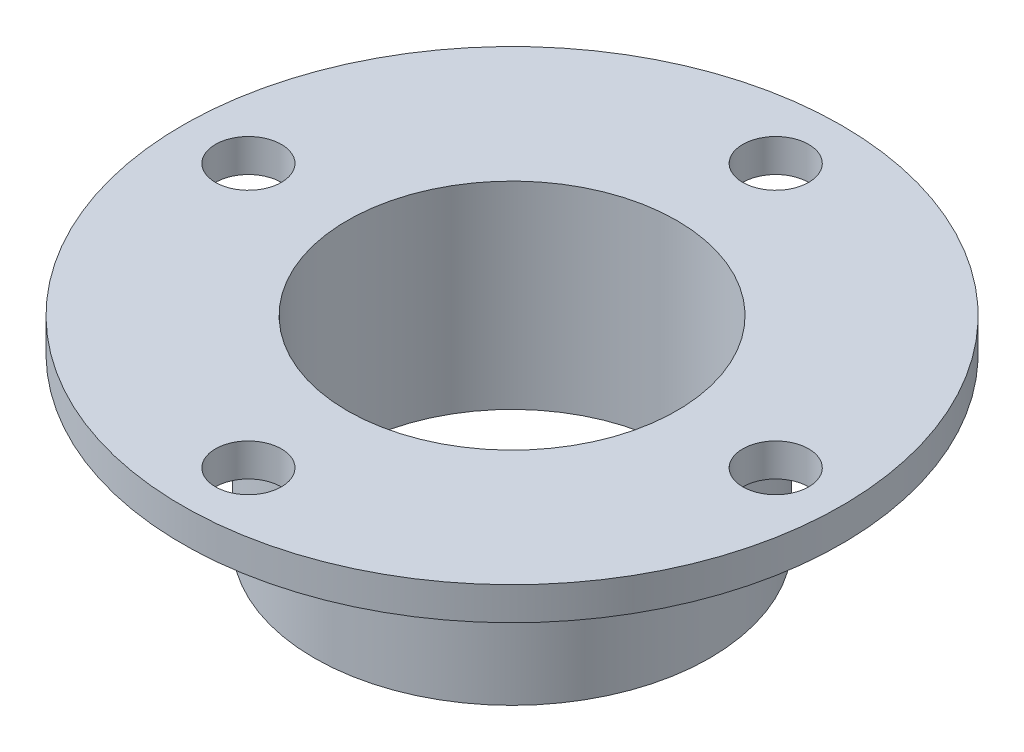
from build123d import *

# Parameters (mm, degrees)
SKETCH2_R          = 31.75
CUT_EXTRUDE1_DEPTH = 98.550550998
SKETCH3_R          = 6.35
CUT_EXTRUDE2_DEPTH = 98.550550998
CIRPATTERN1_COUNT  = 4


with BuildPart() as part:
    # Sketch1 → Revolve1 (revolve)
    with BuildSketch(Plane.XY, mode=Mode.PRIVATE) as revolve1_sk:
        Polygon((0, 0), (0, 38.1), (63.5, 38.1), (63.5, 31.75), (38.1, 31.75), (38.1, 0), align=None)
    revolve(revolve1_sk.sketch.rotate(Axis((0, 0, 0), (0, 1, 0)), 90), axis=Axis((0, 0, 0), (0, 1, 0)))

    # Sketch2 → Cut-Extrude1 (cut, through all)
    with BuildSketch(Plane.XZ):
        with Locations(Location((0, 0, 0), (0, 0, 270))):
            Circle(SKETCH2_R)
    extrude(amount=-CUT_EXTRUDE1_DEPTH, mode=Mode.SUBTRACT)

    # Sketch3 → Cut-Extrude2 (cut, through all)
    with BuildSketch(Plane(origin=(0, 38.1, 0), x_dir=(1, 0, 0), z_dir=(0, 1, 0))):
        with Locations(Location((0, 50.8, 0), (0, 0, 270))):
            Circle(SKETCH3_R)
    cut_extrude2 = extrude(amount=-CUT_EXTRUDE2_DEPTH, mode=Mode.SUBTRACT)

    # CirPattern1: Cut-Extrude2 ×4 about axis
    cirpattern1_axis = Axis((0, 0, 0), (0, 1, 0))
    for i in range(1, CIRPATTERN1_COUNT):
        add(cut_extrude2.rotate(cirpattern1_axis, i * 360 / CIRPATTERN1_COUNT), mode=Mode.SUBTRACT)


solid = part.part
